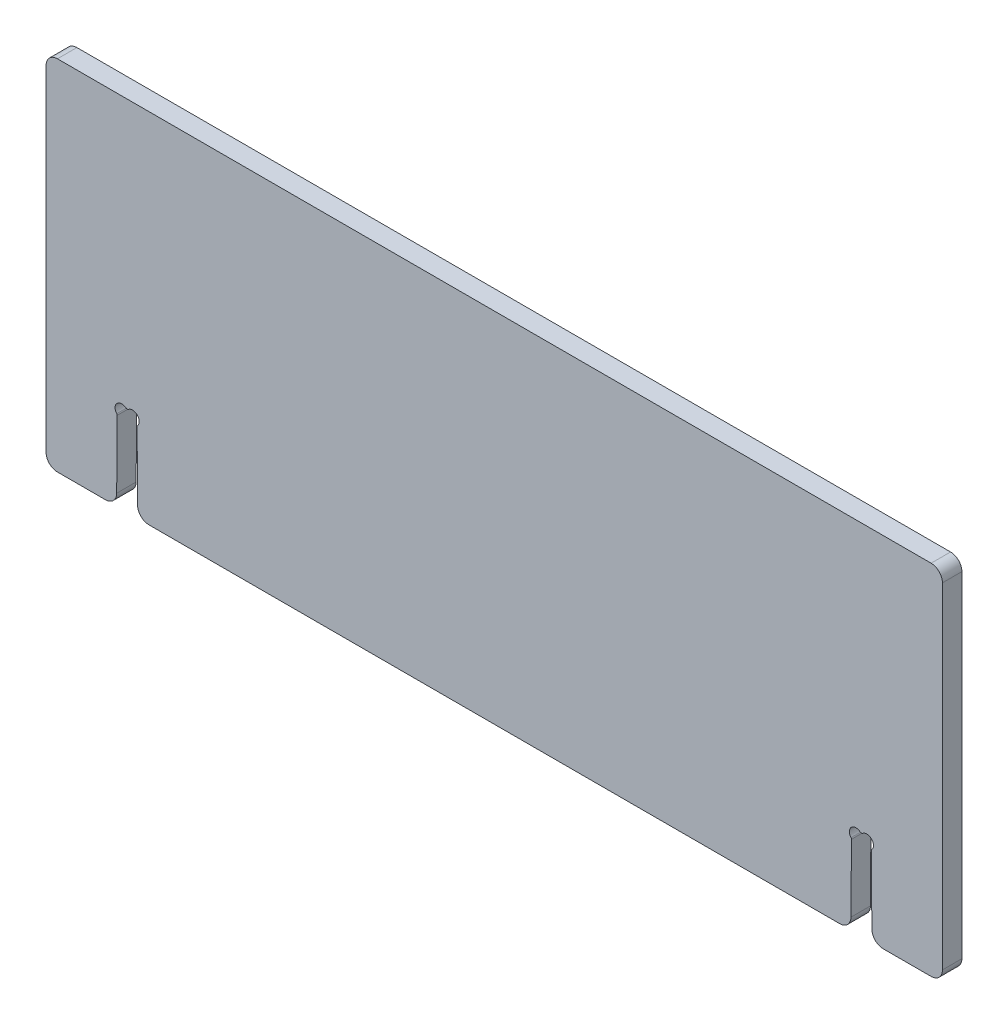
ISO-10303-21;
HEADER;
FILE_DESCRIPTION(('STEP AP214'),'2;1');
FILE_NAME('part.step','',(''),(''),'','','');
FILE_SCHEMA(('AUTOMOTIVE_DESIGN { 1 0 10303 214 1 1 1 1 }'));
ENDSEC;
DATA;
#1=APPLICATION_CONTEXT('core data for automotive mechanical design processes');
#2=APPLICATION_PROTOCOL_DEFINITION('international standard','automotive_design',2000,#1);
#3=PRODUCT_CONTEXT('',#1,'mechanical');
#4=PRODUCT('Part','Part','',(#3));
#5=PRODUCT_RELATED_PRODUCT_CATEGORY('part','',(#4));
#6=PRODUCT_DEFINITION_FORMATION('','',#4);
#7=PRODUCT_DEFINITION_CONTEXT('part definition',#1,'design');
#8=PRODUCT_DEFINITION('design','',#6,#7);
#9=PRODUCT_DEFINITION_SHAPE('','',#8);
#10=(LENGTH_UNIT() NAMED_UNIT(*) SI_UNIT(.MILLI.,.METRE.));
#11=(NAMED_UNIT(*) PLANE_ANGLE_UNIT() SI_UNIT($,.RADIAN.));
#12=(NAMED_UNIT(*) SI_UNIT($,.STERADIAN.) SOLID_ANGLE_UNIT());
#13=UNCERTAINTY_MEASURE_WITH_UNIT(LENGTH_MEASURE(1.E-05),#10,'distance_accuracy_value','');
#14=(GEOMETRIC_REPRESENTATION_CONTEXT(3) GLOBAL_UNCERTAINTY_ASSIGNED_CONTEXT((#13)) GLOBAL_UNIT_ASSIGNED_CONTEXT((#10,
#11,#12)) REPRESENTATION_CONTEXT('',''));
#15=CARTESIAN_POINT('',(0.,0.,0.));
#16=DIRECTION('',(0.,0.,1.));
#17=DIRECTION('',(1.,0.,0.));
#18=AXIS2_PLACEMENT_3D('',#15,#16,#17);
#19=CARTESIAN_POINT('',(0.,0.,12.));
#20=DIRECTION('',(0.,1.,0.));
#21=DIRECTION('',(0.,0.,1.));
#22=AXIS2_PLACEMENT_3D('',#19,#20,#21);
#23=PLANE('',#22);
#24=DIRECTION('',(1.,0.,0.));
#25=VECTOR('',#24,1.);
#26=CARTESIAN_POINT('',(0.,0.,0.));
#27=LINE('',#26,#25);
#28=CARTESIAN_POINT('',(7.,0.,0.));
#29=VERTEX_POINT('',#28);
#30=CARTESIAN_POINT('',(36.5505408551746,0.,0.));
#31=VERTEX_POINT('',#30);
#32=EDGE_CURVE('E458',#29,#31,#27,.T.);
#33=ORIENTED_EDGE('',*,*,#32,.T.);
#34=DIRECTION('',(0.,0.,1.));
#35=VECTOR('',#34,1.);
#36=CARTESIAN_POINT('',(36.5505408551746,0.,12.));
#37=LINE('',#36,#35);
#38=CARTESIAN_POINT('',(36.5505408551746,0.,12.));
#39=VERTEX_POINT('',#38);
#40=EDGE_CURVE('E483',#31,#39,#37,.T.);
#41=ORIENTED_EDGE('',*,*,#40,.T.);
#42=DIRECTION('',(1.,0.,0.));
#43=VECTOR('',#42,1.);
#44=CARTESIAN_POINT('',(0.,0.,12.));
#45=LINE('',#44,#43);
#46=CARTESIAN_POINT('',(7.,0.,12.));
#47=VERTEX_POINT('',#46);
#48=EDGE_CURVE('E451',#47,#39,#45,.T.);
#49=ORIENTED_EDGE('',*,*,#48,.F.);
#50=DIRECTION('',(0.,0.,-1.));
#51=VECTOR('',#50,1.);
#52=CARTESIAN_POINT('',(7.,0.,12.));
#53=LINE('',#52,#51);
#54=EDGE_CURVE('E480',#47,#29,#53,.T.);
#55=ORIENTED_EDGE('',*,*,#54,.T.);
#56=EDGE_LOOP('',(#33,#41,#49,#55));
#57=FACE_BOUND('',#56,.T.);
#58=ADVANCED_FACE('F33',(#57),#23,.F.);
#59=CARTESIAN_POINT('',(0.,0.,12.));
#60=DIRECTION('',(1.,0.,0.));
#61=DIRECTION('',(0.,0.,-1.));
#62=AXIS2_PLACEMENT_3D('',#59,#60,#61);
#63=PLANE('',#62);
#64=DIRECTION('',(0.,-1.,0.));
#65=VECTOR('',#64,1.);
#66=CARTESIAN_POINT('',(0.,0.,0.));
#67=LINE('',#66,#65);
#68=CARTESIAN_POINT('',(0.,213.8,0.));
#69=VERTEX_POINT('',#68);
#70=CARTESIAN_POINT('',(0.,7.,0.));
#71=VERTEX_POINT('',#70);
#72=EDGE_CURVE('E430',#69,#71,#67,.T.);
#73=ORIENTED_EDGE('',*,*,#72,.T.);
#74=DIRECTION('',(0.,0.,-1.));
#75=VECTOR('',#74,1.);
#76=CARTESIAN_POINT('',(0.,7.,12.));
#77=LINE('',#76,#75);
#78=CARTESIAN_POINT('',(0.,7.,12.));
#79=VERTEX_POINT('',#78);
#80=EDGE_CURVE('E41',#71,#79,#77,.F.);
#81=ORIENTED_EDGE('',*,*,#80,.T.);
#82=DIRECTION('',(0.,-1.,0.));
#83=VECTOR('',#82,1.);
#84=CARTESIAN_POINT('',(0.,0.,12.));
#85=LINE('',#84,#83);
#86=CARTESIAN_POINT('',(0.,213.8,12.));
#87=VERTEX_POINT('',#86);
#88=EDGE_CURVE('E445',#87,#79,#85,.T.);
#89=ORIENTED_EDGE('',*,*,#88,.F.);
#90=DIRECTION('',(0.,0.,-1.));
#91=VECTOR('',#90,1.);
#92=CARTESIAN_POINT('',(0.,213.8,12.));
#93=LINE('',#92,#91);
#94=EDGE_CURVE('E488',#87,#69,#93,.T.);
#95=ORIENTED_EDGE('',*,*,#94,.T.);
#96=EDGE_LOOP('',(#73,#81,#89,#95));
#97=FACE_BOUND('',#96,.T.);
#98=ADVANCED_FACE('F493',(#97),#63,.F.);
#99=CARTESIAN_POINT('',(63.4494591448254,0.,12.));
#100=VERTEX_POINT('',#99);
#101=CARTESIAN_POINT('',(489.550540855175,0.,12.));
#102=VERTEX_POINT('',#101);
#103=EDGE_CURVE('E448',#100,#102,#45,.T.);
#104=ORIENTED_EDGE('',*,*,#103,.F.);
#105=DIRECTION('',(0.,0.,1.));
#106=VECTOR('',#105,1.);
#107=CARTESIAN_POINT('',(63.4494591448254,0.,12.));
#108=LINE('',#107,#106);
#109=CARTESIAN_POINT('',(63.4494591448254,0.,0.));
#110=VERTEX_POINT('',#109);
#111=EDGE_CURVE('E472',#100,#110,#108,.F.);
#112=ORIENTED_EDGE('',*,*,#111,.T.);
#113=CARTESIAN_POINT('',(489.550540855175,0.,0.));
#114=VERTEX_POINT('',#113);
#115=EDGE_CURVE('E457',#110,#114,#27,.T.);
#116=ORIENTED_EDGE('',*,*,#115,.T.);
#117=DIRECTION('',(0.,0.,1.));
#118=VECTOR('',#117,1.);
#119=CARTESIAN_POINT('',(489.550540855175,0.,12.));
#120=LINE('',#119,#118);
#121=EDGE_CURVE('E345',#102,#114,#120,.F.);
#122=ORIENTED_EDGE('',*,*,#121,.F.);
#123=EDGE_LOOP('',(#104,#112,#116,#122));
#124=FACE_BOUND('',#123,.T.);
#125=ADVANCED_FACE('F554',(#124),#23,.F.);
#126=CARTESIAN_POINT('',(0.,220.8,12.));
#127=DIRECTION('',(0.,-1.,0.));
#128=DIRECTION('',(0.,0.,-1.));
#129=AXIS2_PLACEMENT_3D('',#126,#127,#128);
#130=PLANE('',#129);
#131=DIRECTION('',(-1.,0.,0.));
#132=VECTOR('',#131,1.);
#133=CARTESIAN_POINT('',(0.,220.8,0.));
#134=LINE('',#133,#132);
#135=CARTESIAN_POINT('',(546.,220.8,0.));
#136=VERTEX_POINT('',#135);
#137=CARTESIAN_POINT('',(7.,220.8,0.));
#138=VERTEX_POINT('',#137);
#139=EDGE_CURVE('E449',#136,#138,#134,.T.);
#140=ORIENTED_EDGE('',*,*,#139,.T.);
#141=DIRECTION('',(0.,0.,-1.));
#142=VECTOR('',#141,1.);
#143=CARTESIAN_POINT('',(7.,220.8,12.));
#144=LINE('',#143,#142);
#145=CARTESIAN_POINT('',(7.,220.8,12.));
#146=VERTEX_POINT('',#145);
#147=EDGE_CURVE('E11',#138,#146,#144,.F.);
#148=ORIENTED_EDGE('',*,*,#147,.T.);
#149=DIRECTION('',(-1.,0.,0.));
#150=VECTOR('',#149,1.);
#151=CARTESIAN_POINT('',(0.,220.8,12.));
#152=LINE('',#151,#150);
#153=CARTESIAN_POINT('',(546.,220.8,12.));
#154=VERTEX_POINT('',#153);
#155=EDGE_CURVE('E452',#154,#146,#152,.T.);
#156=ORIENTED_EDGE('',*,*,#155,.F.);
#157=DIRECTION('',(0.,0.,-1.));
#158=VECTOR('',#157,1.);
#159=CARTESIAN_POINT('',(546.,220.8,12.));
#160=LINE('',#159,#158);
#161=EDGE_CURVE('E372',#136,#154,#160,.F.);
#162=ORIENTED_EDGE('',*,*,#161,.F.);
#163=EDGE_LOOP('',(#140,#148,#156,#162));
#164=FACE_BOUND('',#163,.T.);
#165=ADVANCED_FACE('F607',(#164),#130,.F.);
#166=CARTESIAN_POINT('',(0.,0.,12.));
#167=DIRECTION('',(0.,0.,-1.));
#168=DIRECTION('',(-1.,0.,0.));
#169=AXIS2_PLACEMENT_3D('',#166,#167,#168);
#170=PLANE('',#169);
#171=DIRECTION('',(-0.00724618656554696,0.999973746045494,0.));
#172=VECTOR('',#171,1.);
#173=CARTESIAN_POINT('',(56.1470582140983,48.705966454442,12.));
#174=LINE('',#173,#172);
#175=CARTESIAN_POINT('',(56.449642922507,6.94927669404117,12.));
#176=VERTEX_POINT('',#175);
#177=CARTESIAN_POINT('',(56.1470582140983,48.705966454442,12.));
#178=VERTEX_POINT('',#177);
#179=EDGE_CURVE('E375',#176,#178,#174,.T.);
#180=ORIENTED_EDGE('',*,*,#179,.F.);
#181=CARTESIAN_POINT('',(63.4494591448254,7.,12.));
#182=DIRECTION('',(0.,0.,-1.));
#183=DIRECTION('',(-1.,0.,0.));
#184=AXIS2_PLACEMENT_3D('',#181,#182,#183);
#185=CIRCLE('',#184,7.);
#186=EDGE_CURVE('E470',#176,#100,#185,.F.);
#187=ORIENTED_EDGE('',*,*,#186,.T.);
#188=ORIENTED_EDGE('',*,*,#103,.T.);
#189=CARTESIAN_POINT('',(489.550540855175,7.,12.));
#190=DIRECTION('',(0.,0.,1.));
#191=DIRECTION('',(1.,0.,0.));
#192=AXIS2_PLACEMENT_3D('',#189,#190,#191);
#193=CIRCLE('',#192,7.);
#194=CARTESIAN_POINT('',(496.550357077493,6.94927669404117,12.));
#195=VERTEX_POINT('',#194);
#196=EDGE_CURVE('E342',#195,#102,#193,.F.);
#197=ORIENTED_EDGE('',*,*,#196,.F.);
#198=DIRECTION('',(0.00724618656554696,0.999973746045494,0.));
#199=VECTOR('',#198,1.);
#200=CARTESIAN_POINT('',(496.852941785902,48.705966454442,12.));
#201=LINE('',#200,#199);
#202=CARTESIAN_POINT('',(496.852941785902,48.705966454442,12.));
#203=VERTEX_POINT('',#202);
#204=EDGE_CURVE('E285',#195,#203,#201,.T.);
#205=ORIENTED_EDGE('',*,*,#204,.T.);
#206=CARTESIAN_POINT('',(495.652973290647,48.7146618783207,12.));
#207=DIRECTION('',(0.,0.,1.));
#208=DIRECTION('',(-1.,0.,0.));
#209=AXIS2_PLACEMENT_3D('',#206,#207,#208);
#210=CIRCLE('',#209,1.2);
#211=CARTESIAN_POINT('',(496.561922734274,49.4981227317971,12.));
#212=VERTEX_POINT('',#211);
#213=EDGE_CURVE('E288',#203,#212,#210,.T.);
#214=ORIENTED_EDGE('',*,*,#213,.T.);
#215=CARTESIAN_POINT('',(499.6675,52.1749473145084,12.));
#216=DIRECTION('',(0.,0.,-1.));
#217=DIRECTION('',(1.,0.,0.));
#218=AXIS2_PLACEMENT_3D('',#215,#216,#217);
#219=CIRCLE('',#218,4.1);
#220=CARTESIAN_POINT('',(502.142842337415,55.4433842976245,12.));
#221=VERTEX_POINT('',#220);
#222=EDGE_CURVE('E247',#212,#221,#219,.T.);
#223=ORIENTED_EDGE('',*,*,#222,.T.);
#224=CARTESIAN_POINT('',(502.867332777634,56.4,12.));
#225=DIRECTION('',(0.,0.,1.));
#226=DIRECTION('',(1.,0.,0.));
#227=AXIS2_PLACEMENT_3D('',#224,#225,#226);
#228=CIRCLE('',#227,1.2);
#229=CARTESIAN_POINT('',(502.867332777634,55.2,12.));
#230=VERTEX_POINT('',#229);
#231=EDGE_CURVE('E291',#221,#230,#228,.T.);
#232=ORIENTED_EDGE('',*,*,#231,.T.);
#233=DIRECTION('',(1.,0.,0.));
#234=VECTOR('',#233,1.);
#235=CARTESIAN_POINT('',(503.132667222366,55.2,12.));
#236=LINE('',#235,#234);
#237=CARTESIAN_POINT('',(503.132667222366,55.2,12.));
#238=VERTEX_POINT('',#237);
#239=EDGE_CURVE('E294',#230,#238,#236,.T.);
#240=ORIENTED_EDGE('',*,*,#239,.T.);
#241=CARTESIAN_POINT('',(503.132667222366,56.4,12.));
#242=DIRECTION('',(0.,0.,1.));
#243=DIRECTION('',(-1.,0.,0.));
#244=AXIS2_PLACEMENT_3D('',#241,#242,#243);
#245=CIRCLE('',#244,1.2);
#246=CARTESIAN_POINT('',(503.857157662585,55.4433842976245,12.));
#247=VERTEX_POINT('',#246);
#248=EDGE_CURVE('E297',#238,#247,#245,.T.);
#249=ORIENTED_EDGE('',*,*,#248,.T.);
#250=CARTESIAN_POINT('',(506.3325,52.1749473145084,12.));
#251=DIRECTION('',(0.,0.,-1.));
#252=DIRECTION('',(-1.,0.,0.));
#253=AXIS2_PLACEMENT_3D('',#250,#251,#252);
#254=CIRCLE('',#253,4.1);
#255=CARTESIAN_POINT('',(509.438077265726,49.4981227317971,12.));
#256=VERTEX_POINT('',#255);
#257=EDGE_CURVE('E300',#247,#256,#254,.T.);
#258=ORIENTED_EDGE('',*,*,#257,.T.);
#259=CARTESIAN_POINT('',(510.347026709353,48.7146618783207,12.));
#260=DIRECTION('',(0.,0.,1.));
#261=DIRECTION('',(1.,0.,0.));
#262=AXIS2_PLACEMENT_3D('',#259,#260,#261);
#263=CIRCLE('',#262,1.2);
#264=CARTESIAN_POINT('',(509.147058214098,48.705966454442,12.));
#265=VERTEX_POINT('',#264);
#266=EDGE_CURVE('E303',#256,#265,#263,.T.);
#267=ORIENTED_EDGE('',*,*,#266,.T.);
#268=DIRECTION('',(0.00724618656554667,-0.999973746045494,0.));
#269=VECTOR('',#268,1.);
#270=CARTESIAN_POINT('',(509.147058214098,48.705966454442,12.));
#271=LINE('',#270,#269);
#272=CARTESIAN_POINT('',(509.449642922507,6.94927669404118,12.));
#273=VERTEX_POINT('',#272);
#274=EDGE_CURVE('E306',#265,#273,#271,.T.);
#275=ORIENTED_EDGE('',*,*,#274,.T.);
#276=CARTESIAN_POINT('',(516.449459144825,7.,12.));
#277=DIRECTION('',(0.,0.,1.));
#278=DIRECTION('',(1.,0.,0.));
#279=AXIS2_PLACEMENT_3D('',#276,#277,#278);
#280=CIRCLE('',#279,7.);
#281=CARTESIAN_POINT('',(516.449459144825,0.,12.));
#282=VERTEX_POINT('',#281);
#283=EDGE_CURVE('E339',#282,#273,#280,.F.);
#284=ORIENTED_EDGE('',*,*,#283,.F.);
#285=DIRECTION('',(-1.,0.,0.));
#286=VECTOR('',#285,1.);
#287=CARTESIAN_POINT('',(553.,0.,12.));
#288=LINE('',#287,#286);
#289=CARTESIAN_POINT('',(546.,0.,12.));
#290=VERTEX_POINT('',#289);
#291=EDGE_CURVE('E325',#290,#282,#288,.T.);
#292=ORIENTED_EDGE('',*,*,#291,.F.);
#293=CARTESIAN_POINT('',(546.,7.,12.));
#294=DIRECTION('',(0.,0.,1.));
#295=DIRECTION('',(1.,0.,0.));
#296=AXIS2_PLACEMENT_3D('',#293,#294,#295);
#297=CIRCLE('',#296,7.);
#298=CARTESIAN_POINT('',(553.,7.,12.));
#299=VERTEX_POINT('',#298);
#300=EDGE_CURVE('E337',#299,#290,#297,.F.);
#301=ORIENTED_EDGE('',*,*,#300,.F.);
#302=DIRECTION('',(0.,-1.,0.));
#303=VECTOR('',#302,1.);
#304=CARTESIAN_POINT('',(553.,0.,12.));
#305=LINE('',#304,#303);
#306=CARTESIAN_POINT('',(553.,213.8,12.));
#307=VERTEX_POINT('',#306);
#308=EDGE_CURVE('E322',#307,#299,#305,.T.);
#309=ORIENTED_EDGE('',*,*,#308,.F.);
#310=CARTESIAN_POINT('',(546.,213.8,12.));
#311=DIRECTION('',(0.,0.,1.));
#312=DIRECTION('',(1.,0.,0.));
#313=AXIS2_PLACEMENT_3D('',#310,#311,#312);
#314=CIRCLE('',#313,7.);
#315=EDGE_CURVE('E335',#154,#307,#314,.F.);
#316=ORIENTED_EDGE('',*,*,#315,.F.);
#317=ORIENTED_EDGE('',*,*,#155,.T.);
#318=CARTESIAN_POINT('',(7.,213.8,12.));
#319=DIRECTION('',(0.,0.,-1.));
#320=DIRECTION('',(-1.,0.,0.));
#321=AXIS2_PLACEMENT_3D('',#318,#319,#320);
#322=CIRCLE('',#321,7.);
#323=EDGE_CURVE('E464',#146,#87,#322,.F.);
#324=ORIENTED_EDGE('',*,*,#323,.T.);
#325=ORIENTED_EDGE('',*,*,#88,.T.);
#326=CARTESIAN_POINT('',(7.,7.,12.));
#327=DIRECTION('',(0.,0.,-1.));
#328=DIRECTION('',(-1.,0.,0.));
#329=AXIS2_PLACEMENT_3D('',#326,#327,#328);
#330=CIRCLE('',#329,7.);
#331=EDGE_CURVE('E466',#79,#47,#330,.F.);
#332=ORIENTED_EDGE('',*,*,#331,.T.);
#333=ORIENTED_EDGE('',*,*,#48,.T.);
#334=CARTESIAN_POINT('',(36.5505408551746,7.,12.));
#335=DIRECTION('',(0.,0.,-1.));
#336=DIRECTION('',(-1.,0.,0.));
#337=AXIS2_PLACEMENT_3D('',#334,#335,#336);
#338=CIRCLE('',#337,7.);
#339=CARTESIAN_POINT('',(43.5503570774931,6.94927669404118,12.));
#340=VERTEX_POINT('',#339);
#341=EDGE_CURVE('E468',#39,#340,#338,.F.);
#342=ORIENTED_EDGE('',*,*,#341,.T.);
#343=DIRECTION('',(-0.00724618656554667,-0.999973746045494,0.));
#344=VECTOR('',#343,1.);
#345=CARTESIAN_POINT('',(43.8529417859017,48.705966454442,12.));
#346=LINE('',#345,#344);
#347=CARTESIAN_POINT('',(43.8529417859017,48.705966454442,12.));
#348=VERTEX_POINT('',#347);
#349=EDGE_CURVE('E379',#348,#340,#346,.T.);
#350=ORIENTED_EDGE('',*,*,#349,.F.);
#351=CARTESIAN_POINT('',(42.6529732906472,48.7146618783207,12.));
#352=DIRECTION('',(0.,0.,-1.));
#353=DIRECTION('',(-1.,0.,0.));
#354=AXIS2_PLACEMENT_3D('',#351,#352,#353);
#355=CIRCLE('',#354,1.2);
#356=CARTESIAN_POINT('',(43.5619227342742,49.4981227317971,12.));
#357=VERTEX_POINT('',#356);
#358=EDGE_CURVE('E423',#357,#348,#355,.T.);
#359=ORIENTED_EDGE('',*,*,#358,.F.);
#360=CARTESIAN_POINT('',(46.6675,52.1749473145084,12.));
#361=DIRECTION('',(0.,0.,1.));
#362=DIRECTION('',(1.,0.,0.));
#363=AXIS2_PLACEMENT_3D('',#360,#361,#362);
#364=CIRCLE('',#363,4.1);
#365=CARTESIAN_POINT('',(49.1428423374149,55.4433842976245,12.));
#366=VERTEX_POINT('',#365);
#367=EDGE_CURVE('E420',#366,#357,#364,.T.);
#368=ORIENTED_EDGE('',*,*,#367,.F.);
#369=CARTESIAN_POINT('',(49.8673327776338,56.4,12.));
#370=DIRECTION('',(0.,0.,-1.));
#371=DIRECTION('',(1.,0.,0.));
#372=AXIS2_PLACEMENT_3D('',#369,#370,#371);
#373=CIRCLE('',#372,1.2);
#374=CARTESIAN_POINT('',(49.8673327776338,55.2,12.));
#375=VERTEX_POINT('',#374);
#376=EDGE_CURVE('E417',#375,#366,#373,.T.);
#377=ORIENTED_EDGE('',*,*,#376,.F.);
#378=DIRECTION('',(-1.,0.,0.));
#379=VECTOR('',#378,1.);
#380=CARTESIAN_POINT('',(49.8673327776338,55.2,12.));
#381=LINE('',#380,#379);
#382=CARTESIAN_POINT('',(50.1326672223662,55.2,12.));
#383=VERTEX_POINT('',#382);
#384=EDGE_CURVE('E414',#383,#375,#381,.T.);
#385=ORIENTED_EDGE('',*,*,#384,.F.);
#386=CARTESIAN_POINT('',(50.1326672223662,56.4,12.));
#387=DIRECTION('',(0.,0.,-1.));
#388=DIRECTION('',(-1.,0.,0.));
#389=AXIS2_PLACEMENT_3D('',#386,#387,#388);
#390=CIRCLE('',#389,1.2);
#391=CARTESIAN_POINT('',(50.8571576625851,55.4433842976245,12.));
#392=VERTEX_POINT('',#391);
#393=EDGE_CURVE('E411',#392,#383,#390,.T.);
#394=ORIENTED_EDGE('',*,*,#393,.F.);
#395=CARTESIAN_POINT('',(53.3325,52.1749473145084,12.));
#396=DIRECTION('',(0.,0.,1.));
#397=DIRECTION('',(-1.,0.,0.));
#398=AXIS2_PLACEMENT_3D('',#395,#396,#397);
#399=CIRCLE('',#398,4.1);
#400=CARTESIAN_POINT('',(56.4380772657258,49.4981227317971,12.));
#401=VERTEX_POINT('',#400);
#402=EDGE_CURVE('E408',#401,#392,#399,.T.);
#403=ORIENTED_EDGE('',*,*,#402,.F.);
#404=CARTESIAN_POINT('',(57.3470267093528,48.7146618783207,12.));
#405=DIRECTION('',(0.,0.,-1.));
#406=DIRECTION('',(1.,0.,0.));
#407=AXIS2_PLACEMENT_3D('',#404,#405,#406);
#408=CIRCLE('',#407,1.2);
#409=EDGE_CURVE('E405',#178,#401,#408,.T.);
#410=ORIENTED_EDGE('',*,*,#409,.F.);
#411=EDGE_LOOP('',(#180,#187,#188,#197,#205,#214,#223,#232,#240,#249,#258,#267,#275,#284,#292,
#301,#309,#316,#317,#324,#325,#332,#333,#342,#350,#359,#368,#377,#385,#394,#403,#410));
#412=FACE_BOUND('',#411,.T.);
#413=ADVANCED_FACE('F499',(#412),#170,.F.);
#414=CARTESIAN_POINT('',(0.,0.,0.));
#415=DIRECTION('',(0.,0.,-1.));
#416=DIRECTION('',(-1.,0.,0.));
#417=AXIS2_PLACEMENT_3D('',#414,#415,#416);
#418=PLANE('',#417);
#419=ORIENTED_EDGE('',*,*,#115,.F.);
#420=CARTESIAN_POINT('',(63.4494591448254,7.,0.));
#421=DIRECTION('',(0.,0.,-1.));
#422=DIRECTION('',(-1.,0.,0.));
#423=AXIS2_PLACEMENT_3D('',#420,#421,#422);
#424=CIRCLE('',#423,7.);
#425=CARTESIAN_POINT('',(56.449642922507,6.94927669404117,0.));
#426=VERTEX_POINT('',#425);
#427=EDGE_CURVE('E478',#110,#426,#424,.T.);
#428=ORIENTED_EDGE('',*,*,#427,.T.);
#429=DIRECTION('',(-0.00724618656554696,0.999973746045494,0.));
#430=VECTOR('',#429,1.);
#431=CARTESIAN_POINT('',(56.1470582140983,48.705966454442,0.));
#432=LINE('',#431,#430);
#433=CARTESIAN_POINT('',(56.1470582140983,48.705966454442,0.));
#434=VERTEX_POINT('',#433);
#435=EDGE_CURVE('E376',#426,#434,#432,.T.);
#436=ORIENTED_EDGE('',*,*,#435,.T.);
#437=CARTESIAN_POINT('',(57.3470267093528,48.7146618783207,0.));
#438=DIRECTION('',(0.,0.,-1.));
#439=DIRECTION('',(1.,0.,0.));
#440=AXIS2_PLACEMENT_3D('',#437,#438,#439);
#441=CIRCLE('',#440,1.2);
#442=CARTESIAN_POINT('',(56.4380772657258,49.4981227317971,0.));
#443=VERTEX_POINT('',#442);
#444=EDGE_CURVE('E378',#434,#443,#441,.T.);
#445=ORIENTED_EDGE('',*,*,#444,.T.);
#446=CARTESIAN_POINT('',(53.3325,52.1749473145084,0.));
#447=DIRECTION('',(0.,0.,1.));
#448=DIRECTION('',(-1.,0.,0.));
#449=AXIS2_PLACEMENT_3D('',#446,#447,#448);
#450=CIRCLE('',#449,4.1);
#451=CARTESIAN_POINT('',(50.8571576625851,55.4433842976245,0.));
#452=VERTEX_POINT('',#451);
#453=EDGE_CURVE('E382',#443,#452,#450,.T.);
#454=ORIENTED_EDGE('',*,*,#453,.T.);
#455=CARTESIAN_POINT('',(50.1326672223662,56.4,0.));
#456=DIRECTION('',(0.,0.,-1.));
#457=DIRECTION('',(-1.,0.,0.));
#458=AXIS2_PLACEMENT_3D('',#455,#456,#457);
#459=CIRCLE('',#458,1.2);
#460=CARTESIAN_POINT('',(50.1326672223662,55.2,0.));
#461=VERTEX_POINT('',#460);
#462=EDGE_CURVE('E385',#452,#461,#459,.T.);
#463=ORIENTED_EDGE('',*,*,#462,.T.);
#464=DIRECTION('',(-1.,0.,0.));
#465=VECTOR('',#464,1.);
#466=CARTESIAN_POINT('',(49.8673327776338,55.2,0.));
#467=LINE('',#466,#465);
#468=CARTESIAN_POINT('',(49.8673327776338,55.2,0.));
#469=VERTEX_POINT('',#468);
#470=EDGE_CURVE('E388',#461,#469,#467,.T.);
#471=ORIENTED_EDGE('',*,*,#470,.T.);
#472=CARTESIAN_POINT('',(49.8673327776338,56.4,0.));
#473=DIRECTION('',(0.,0.,-1.));
#474=DIRECTION('',(1.,0.,0.));
#475=AXIS2_PLACEMENT_3D('',#472,#473,#474);
#476=CIRCLE('',#475,1.2);
#477=CARTESIAN_POINT('',(49.1428423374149,55.4433842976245,0.));
#478=VERTEX_POINT('',#477);
#479=EDGE_CURVE('E391',#469,#478,#476,.T.);
#480=ORIENTED_EDGE('',*,*,#479,.T.);
#481=CARTESIAN_POINT('',(46.6675,52.1749473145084,0.));
#482=DIRECTION('',(0.,0.,1.));
#483=DIRECTION('',(1.,0.,0.));
#484=AXIS2_PLACEMENT_3D('',#481,#482,#483);
#485=CIRCLE('',#484,4.1);
#486=CARTESIAN_POINT('',(43.5619227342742,49.4981227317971,0.));
#487=VERTEX_POINT('',#486);
#488=EDGE_CURVE('E394',#478,#487,#485,.T.);
#489=ORIENTED_EDGE('',*,*,#488,.T.);
#490=CARTESIAN_POINT('',(42.6529732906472,48.7146618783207,0.));
#491=DIRECTION('',(0.,0.,-1.));
#492=DIRECTION('',(-1.,0.,0.));
#493=AXIS2_PLACEMENT_3D('',#490,#491,#492);
#494=CIRCLE('',#493,1.2);
#495=CARTESIAN_POINT('',(43.8529417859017,48.705966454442,0.));
#496=VERTEX_POINT('',#495);
#497=EDGE_CURVE('E397',#487,#496,#494,.T.);
#498=ORIENTED_EDGE('',*,*,#497,.T.);
#499=DIRECTION('',(-0.00724618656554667,-0.999973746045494,0.));
#500=VECTOR('',#499,1.);
#501=CARTESIAN_POINT('',(43.8529417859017,48.705966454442,0.));
#502=LINE('',#501,#500);
#503=CARTESIAN_POINT('',(43.5503570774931,6.94927669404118,0.));
#504=VERTEX_POINT('',#503);
#505=EDGE_CURVE('E400',#496,#504,#502,.T.);
#506=ORIENTED_EDGE('',*,*,#505,.T.);
#507=CARTESIAN_POINT('',(36.5505408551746,7.,0.));
#508=DIRECTION('',(0.,0.,-1.));
#509=DIRECTION('',(-1.,0.,0.));
#510=AXIS2_PLACEMENT_3D('',#507,#508,#509);
#511=CIRCLE('',#510,7.);
#512=EDGE_CURVE('E476',#504,#31,#511,.T.);
#513=ORIENTED_EDGE('',*,*,#512,.T.);
#514=ORIENTED_EDGE('',*,*,#32,.F.);
#515=CARTESIAN_POINT('',(7.,7.,0.));
#516=DIRECTION('',(0.,0.,-1.));
#517=DIRECTION('',(-1.,0.,0.));
#518=AXIS2_PLACEMENT_3D('',#515,#516,#517);
#519=CIRCLE('',#518,7.);
#520=EDGE_CURVE('E54',#29,#71,#519,.T.);
#521=ORIENTED_EDGE('',*,*,#520,.T.);
#522=ORIENTED_EDGE('',*,*,#72,.F.);
#523=CARTESIAN_POINT('',(7.,213.8,0.));
#524=DIRECTION('',(0.,0.,-1.));
#525=DIRECTION('',(-1.,0.,0.));
#526=AXIS2_PLACEMENT_3D('',#523,#524,#525);
#527=CIRCLE('',#526,7.);
#528=EDGE_CURVE('E48',#69,#138,#527,.T.);
#529=ORIENTED_EDGE('',*,*,#528,.T.);
#530=ORIENTED_EDGE('',*,*,#139,.F.);
#531=CARTESIAN_POINT('',(546.,213.8,0.));
#532=DIRECTION('',(0.,0.,1.));
#533=DIRECTION('',(1.,0.,0.));
#534=AXIS2_PLACEMENT_3D('',#531,#532,#533);
#535=CIRCLE('',#534,7.);
#536=CARTESIAN_POINT('',(553.,213.8,0.));
#537=VERTEX_POINT('',#536);
#538=EDGE_CURVE('E348',#537,#136,#535,.T.);
#539=ORIENTED_EDGE('',*,*,#538,.F.);
#540=DIRECTION('',(0.,-1.,0.));
#541=VECTOR('',#540,1.);
#542=CARTESIAN_POINT('',(553.,0.,0.));
#543=LINE('',#542,#541);
#544=CARTESIAN_POINT('',(553.,7.,0.));
#545=VERTEX_POINT('',#544);
#546=EDGE_CURVE('E311',#537,#545,#543,.T.);
#547=ORIENTED_EDGE('',*,*,#546,.T.);
#548=CARTESIAN_POINT('',(546.,7.,0.));
#549=DIRECTION('',(0.,0.,1.));
#550=DIRECTION('',(1.,0.,0.));
#551=AXIS2_PLACEMENT_3D('',#548,#549,#550);
#552=CIRCLE('',#551,7.);
#553=CARTESIAN_POINT('',(546.,0.,0.));
#554=VERTEX_POINT('',#553);
#555=EDGE_CURVE('E351',#554,#545,#552,.T.);
#556=ORIENTED_EDGE('',*,*,#555,.F.);
#557=DIRECTION('',(-1.,0.,0.));
#558=VECTOR('',#557,1.);
#559=CARTESIAN_POINT('',(553.,0.,0.));
#560=LINE('',#559,#558);
#561=CARTESIAN_POINT('',(516.449459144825,0.,0.));
#562=VERTEX_POINT('',#561);
#563=EDGE_CURVE('E326',#554,#562,#560,.T.);
#564=ORIENTED_EDGE('',*,*,#563,.T.);
#565=CARTESIAN_POINT('',(516.449459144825,7.,0.));
#566=DIRECTION('',(0.,0.,1.));
#567=DIRECTION('',(1.,0.,0.));
#568=AXIS2_PLACEMENT_3D('',#565,#566,#567);
#569=CIRCLE('',#568,7.);
#570=CARTESIAN_POINT('',(509.449642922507,6.94927669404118,0.));
#571=VERTEX_POINT('',#570);
#572=EDGE_CURVE('E353',#571,#562,#569,.T.);
#573=ORIENTED_EDGE('',*,*,#572,.F.);
#574=DIRECTION('',(0.00724618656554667,-0.999973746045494,0.));
#575=VECTOR('',#574,1.);
#576=CARTESIAN_POINT('',(509.147058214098,48.705966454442,0.));
#577=LINE('',#576,#575);
#578=CARTESIAN_POINT('',(509.147058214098,48.705966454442,0.));
#579=VERTEX_POINT('',#578);
#580=EDGE_CURVE('E282',#579,#571,#577,.T.);
#581=ORIENTED_EDGE('',*,*,#580,.F.);
#582=CARTESIAN_POINT('',(510.347026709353,48.7146618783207,0.));
#583=DIRECTION('',(0.,0.,1.));
#584=DIRECTION('',(1.,0.,0.));
#585=AXIS2_PLACEMENT_3D('',#582,#583,#584);
#586=CIRCLE('',#585,1.2);
#587=CARTESIAN_POINT('',(509.438077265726,49.4981227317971,0.));
#588=VERTEX_POINT('',#587);
#589=EDGE_CURVE('E279',#588,#579,#586,.T.);
#590=ORIENTED_EDGE('',*,*,#589,.F.);
#591=CARTESIAN_POINT('',(506.3325,52.1749473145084,0.));
#592=DIRECTION('',(0.,0.,-1.));
#593=DIRECTION('',(-1.,0.,0.));
#594=AXIS2_PLACEMENT_3D('',#591,#592,#593);
#595=CIRCLE('',#594,4.1);
#596=CARTESIAN_POINT('',(503.857157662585,55.4433842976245,0.));
#597=VERTEX_POINT('',#596);
#598=EDGE_CURVE('E276',#597,#588,#595,.T.);
#599=ORIENTED_EDGE('',*,*,#598,.F.);
#600=CARTESIAN_POINT('',(503.132667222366,56.4,0.));
#601=DIRECTION('',(0.,0.,1.));
#602=DIRECTION('',(-1.,0.,0.));
#603=AXIS2_PLACEMENT_3D('',#600,#601,#602);
#604=CIRCLE('',#603,1.2);
#605=CARTESIAN_POINT('',(503.132667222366,55.2,0.));
#606=VERTEX_POINT('',#605);
#607=EDGE_CURVE('E273',#606,#597,#604,.T.);
#608=ORIENTED_EDGE('',*,*,#607,.F.);
#609=DIRECTION('',(1.,0.,0.));
#610=VECTOR('',#609,1.);
#611=CARTESIAN_POINT('',(503.132667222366,55.2,0.));
#612=LINE('',#611,#610);
#613=CARTESIAN_POINT('',(502.867332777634,55.2,0.));
#614=VERTEX_POINT('',#613);
#615=EDGE_CURVE('E267',#614,#606,#612,.T.);
#616=ORIENTED_EDGE('',*,*,#615,.F.);
#617=CARTESIAN_POINT('',(502.867332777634,56.4,0.));
#618=DIRECTION('',(0.,0.,1.));
#619=DIRECTION('',(1.,0.,0.));
#620=AXIS2_PLACEMENT_3D('',#617,#618,#619);
#621=CIRCLE('',#620,1.2);
#622=CARTESIAN_POINT('',(502.142842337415,55.4433842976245,0.));
#623=VERTEX_POINT('',#622);
#624=EDGE_CURVE('E265',#623,#614,#621,.T.);
#625=ORIENTED_EDGE('',*,*,#624,.F.);
#626=CARTESIAN_POINT('',(499.6675,52.1749473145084,0.));
#627=DIRECTION('',(0.,0.,-1.));
#628=DIRECTION('',(1.,0.,0.));
#629=AXIS2_PLACEMENT_3D('',#626,#627,#628);
#630=CIRCLE('',#629,4.1);
#631=CARTESIAN_POINT('',(496.561922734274,49.4981227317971,0.));
#632=VERTEX_POINT('',#631);
#633=EDGE_CURVE('E244',#632,#623,#630,.T.);
#634=ORIENTED_EDGE('',*,*,#633,.F.);
#635=CARTESIAN_POINT('',(495.652973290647,48.7146618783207,0.));
#636=DIRECTION('',(0.,0.,1.));
#637=DIRECTION('',(-1.,0.,0.));
#638=AXIS2_PLACEMENT_3D('',#635,#636,#637);
#639=CIRCLE('',#638,1.2);
#640=CARTESIAN_POINT('',(496.852941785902,48.705966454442,0.));
#641=VERTEX_POINT('',#640);
#642=EDGE_CURVE('E255',#641,#632,#639,.T.);
#643=ORIENTED_EDGE('',*,*,#642,.F.);
#644=DIRECTION('',(0.00724618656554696,0.999973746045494,0.));
#645=VECTOR('',#644,1.);
#646=CARTESIAN_POINT('',(496.852941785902,48.705966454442,0.));
#647=LINE('',#646,#645);
#648=CARTESIAN_POINT('',(496.550357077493,6.94927669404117,0.));
#649=VERTEX_POINT('',#648);
#650=EDGE_CURVE('E259',#649,#641,#647,.T.);
#651=ORIENTED_EDGE('',*,*,#650,.F.);
#652=CARTESIAN_POINT('',(489.550540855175,7.,0.));
#653=DIRECTION('',(0.,0.,1.));
#654=DIRECTION('',(1.,0.,0.));
#655=AXIS2_PLACEMENT_3D('',#652,#653,#654);
#656=CIRCLE('',#655,7.);
#657=EDGE_CURVE('E355',#114,#649,#656,.T.);
#658=ORIENTED_EDGE('',*,*,#657,.F.);
#659=EDGE_LOOP('',(#419,#428,#436,#445,#454,#463,#471,#480,#489,#498,#506,#513,#514,#521,#522,
#529,#530,#539,#547,#556,#564,#573,#581,#590,#599,#608,#616,#625,#634,#643,#651,#658));
#660=FACE_BOUND('',#659,.T.);
#661=ADVANCED_FACE('F262',(#660),#418,.T.);
#662=CARTESIAN_POINT('',(43.8529417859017,48.705966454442,0.));
#663=DIRECTION('',(-0.999973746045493,0.00724618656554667,0.));
#664=DIRECTION('',(-0.00724618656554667,-0.999973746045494,0.));
#665=AXIS2_PLACEMENT_3D('',#662,#663,#664);
#666=PLANE('',#665);
#667=ORIENTED_EDGE('',*,*,#349,.T.);
#668=DIRECTION('',(0.,0.,1.));
#669=VECTOR('',#668,1.);
#670=CARTESIAN_POINT('',(43.5503570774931,6.94927669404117,0.));
#671=LINE('',#670,#669);
#672=EDGE_CURVE('E486',#340,#504,#671,.F.);
#673=ORIENTED_EDGE('',*,*,#672,.T.);
#674=ORIENTED_EDGE('',*,*,#505,.F.);
#675=DIRECTION('',(0.,0.,1.));
#676=VECTOR('',#675,1.);
#677=CARTESIAN_POINT('',(43.8529417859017,48.705966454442,0.));
#678=LINE('',#677,#676);
#679=EDGE_CURVE('E428',#496,#348,#678,.T.);
#680=ORIENTED_EDGE('',*,*,#679,.T.);
#681=EDGE_LOOP('',(#667,#673,#674,#680));
#682=FACE_BOUND('',#681,.T.);
#683=ADVANCED_FACE('F515',(#682),#666,.F.);
#684=CARTESIAN_POINT('',(42.6529732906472,48.7146618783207,0.));
#685=DIRECTION('',(0.,0.,1.));
#686=DIRECTION('',(1.,0.,0.));
#687=AXIS2_PLACEMENT_3D('',#684,#685,#686);
#688=CYLINDRICAL_SURFACE('',#687,1.2);
#689=ORIENTED_EDGE('',*,*,#358,.T.);
#690=ORIENTED_EDGE('',*,*,#679,.F.);
#691=ORIENTED_EDGE('',*,*,#497,.F.);
#692=DIRECTION('',(0.,0.,1.));
#693=VECTOR('',#692,1.);
#694=CARTESIAN_POINT('',(43.5619227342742,49.4981227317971,0.));
#695=LINE('',#694,#693);
#696=EDGE_CURVE('E431',#487,#357,#695,.T.);
#697=ORIENTED_EDGE('',*,*,#696,.T.);
#698=EDGE_LOOP('',(#689,#690,#691,#697));
#699=FACE_BOUND('',#698,.T.);
#700=ADVANCED_FACE('F518',(#699),#688,.T.);
#701=CARTESIAN_POINT('',(46.6675,52.1749473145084,0.));
#702=DIRECTION('',(0.,0.,1.));
#703=DIRECTION('',(1.,0.,0.));
#704=AXIS2_PLACEMENT_3D('',#701,#702,#703);
#705=CYLINDRICAL_SURFACE('',#704,4.1);
#706=ORIENTED_EDGE('',*,*,#367,.T.);
#707=ORIENTED_EDGE('',*,*,#696,.F.);
#708=ORIENTED_EDGE('',*,*,#488,.F.);
#709=DIRECTION('',(0.,0.,1.));
#710=VECTOR('',#709,1.);
#711=CARTESIAN_POINT('',(49.1428423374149,55.4433842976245,0.));
#712=LINE('',#711,#710);
#713=EDGE_CURVE('E433',#478,#366,#712,.T.);
#714=ORIENTED_EDGE('',*,*,#713,.T.);
#715=EDGE_LOOP('',(#706,#707,#708,#714));
#716=FACE_BOUND('',#715,.T.);
#717=ADVANCED_FACE('F523',(#716),#705,.F.);
#718=CARTESIAN_POINT('',(49.8673327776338,56.4,0.));
#719=DIRECTION('',(0.,0.,1.));
#720=DIRECTION('',(1.,0.,0.));
#721=AXIS2_PLACEMENT_3D('',#718,#719,#720);
#722=CYLINDRICAL_SURFACE('',#721,1.2);
#723=ORIENTED_EDGE('',*,*,#376,.T.);
#724=ORIENTED_EDGE('',*,*,#713,.F.);
#725=ORIENTED_EDGE('',*,*,#479,.F.);
#726=DIRECTION('',(0.,0.,1.));
#727=VECTOR('',#726,1.);
#728=CARTESIAN_POINT('',(49.8673327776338,55.2,0.));
#729=LINE('',#728,#727);
#730=EDGE_CURVE('E435',#469,#375,#729,.T.);
#731=ORIENTED_EDGE('',*,*,#730,.T.);
#732=EDGE_LOOP('',(#723,#724,#725,#731));
#733=FACE_BOUND('',#732,.T.);
#734=ADVANCED_FACE('F527',(#733),#722,.T.);
#735=CARTESIAN_POINT('',(49.8673327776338,55.2,0.));
#736=DIRECTION('',(0.,1.,0.));
#737=DIRECTION('',(0.,0.,1.));
#738=AXIS2_PLACEMENT_3D('',#735,#736,#737);
#739=PLANE('',#738);
#740=ORIENTED_EDGE('',*,*,#384,.T.);
#741=ORIENTED_EDGE('',*,*,#730,.F.);
#742=ORIENTED_EDGE('',*,*,#470,.F.);
#743=DIRECTION('',(0.,0.,1.));
#744=VECTOR('',#743,1.);
#745=CARTESIAN_POINT('',(50.1326672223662,55.2,0.));
#746=LINE('',#745,#744);
#747=EDGE_CURVE('E437',#461,#383,#746,.T.);
#748=ORIENTED_EDGE('',*,*,#747,.T.);
#749=EDGE_LOOP('',(#740,#741,#742,#748));
#750=FACE_BOUND('',#749,.T.);
#751=ADVANCED_FACE('F530',(#750),#739,.F.);
#752=CARTESIAN_POINT('',(50.1326672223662,56.4,0.));
#753=DIRECTION('',(0.,0.,1.));
#754=DIRECTION('',(1.,0.,0.));
#755=AXIS2_PLACEMENT_3D('',#752,#753,#754);
#756=CYLINDRICAL_SURFACE('',#755,1.2);
#757=ORIENTED_EDGE('',*,*,#393,.T.);
#758=ORIENTED_EDGE('',*,*,#747,.F.);
#759=ORIENTED_EDGE('',*,*,#462,.F.);
#760=DIRECTION('',(0.,0.,1.));
#761=VECTOR('',#760,1.);
#762=CARTESIAN_POINT('',(50.8571576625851,55.4433842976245,0.));
#763=LINE('',#762,#761);
#764=EDGE_CURVE('E439',#452,#392,#763,.T.);
#765=ORIENTED_EDGE('',*,*,#764,.T.);
#766=EDGE_LOOP('',(#757,#758,#759,#765));
#767=FACE_BOUND('',#766,.T.);
#768=ADVANCED_FACE('F535',(#767),#756,.T.);
#769=CARTESIAN_POINT('',(53.3325,52.1749473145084,0.));
#770=DIRECTION('',(0.,0.,1.));
#771=DIRECTION('',(1.,0.,0.));
#772=AXIS2_PLACEMENT_3D('',#769,#770,#771);
#773=CYLINDRICAL_SURFACE('',#772,4.1);
#774=ORIENTED_EDGE('',*,*,#402,.T.);
#775=ORIENTED_EDGE('',*,*,#764,.F.);
#776=ORIENTED_EDGE('',*,*,#453,.F.);
#777=DIRECTION('',(0.,0.,1.));
#778=VECTOR('',#777,1.);
#779=CARTESIAN_POINT('',(56.4380772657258,49.4981227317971,0.));
#780=LINE('',#779,#778);
#781=EDGE_CURVE('E441',#443,#401,#780,.T.);
#782=ORIENTED_EDGE('',*,*,#781,.T.);
#783=EDGE_LOOP('',(#774,#775,#776,#782));
#784=FACE_BOUND('',#783,.T.);
#785=ADVANCED_FACE('F539',(#784),#773,.F.);
#786=CARTESIAN_POINT('',(57.3470267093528,48.7146618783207,0.));
#787=DIRECTION('',(0.,0.,1.));
#788=DIRECTION('',(1.,0.,0.));
#789=AXIS2_PLACEMENT_3D('',#786,#787,#788);
#790=CYLINDRICAL_SURFACE('',#789,1.2);
#791=ORIENTED_EDGE('',*,*,#409,.T.);
#792=ORIENTED_EDGE('',*,*,#781,.F.);
#793=ORIENTED_EDGE('',*,*,#444,.F.);
#794=DIRECTION('',(0.,0.,1.));
#795=VECTOR('',#794,1.);
#796=CARTESIAN_POINT('',(56.1470582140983,48.705966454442,0.));
#797=LINE('',#796,#795);
#798=EDGE_CURVE('E403',#434,#178,#797,.T.);
#799=ORIENTED_EDGE('',*,*,#798,.T.);
#800=EDGE_LOOP('',(#791,#792,#793,#799));
#801=FACE_BOUND('',#800,.T.);
#802=ADVANCED_FACE('F542',(#801),#790,.T.);
#803=CARTESIAN_POINT('',(56.1470582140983,48.705966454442,0.));
#804=DIRECTION('',(0.999973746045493,0.00724618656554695,0.));
#805=DIRECTION('',(-0.00724618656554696,0.999973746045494,0.));
#806=AXIS2_PLACEMENT_3D('',#803,#804,#805);
#807=PLANE('',#806);
#808=ORIENTED_EDGE('',*,*,#435,.F.);
#809=DIRECTION('',(0.,0.,1.));
#810=VECTOR('',#809,1.);
#811=CARTESIAN_POINT('',(56.449642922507,6.94927669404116,0.));
#812=LINE('',#811,#810);
#813=EDGE_CURVE('E455',#426,#176,#812,.T.);
#814=ORIENTED_EDGE('',*,*,#813,.T.);
#815=ORIENTED_EDGE('',*,*,#179,.T.);
#816=ORIENTED_EDGE('',*,*,#798,.F.);
#817=EDGE_LOOP('',(#808,#814,#815,#816));
#818=FACE_BOUND('',#817,.T.);
#819=ADVANCED_FACE('F547',(#818),#807,.F.);
#820=CARTESIAN_POINT('',(63.4494591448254,7.,0.));
#821=DIRECTION('',(0.,0.,1.));
#822=DIRECTION('',(1.,0.,0.));
#823=AXIS2_PLACEMENT_3D('',#820,#821,#822);
#824=CYLINDRICAL_SURFACE('',#823,7.);
#825=ORIENTED_EDGE('',*,*,#427,.F.);
#826=ORIENTED_EDGE('',*,*,#111,.F.);
#827=ORIENTED_EDGE('',*,*,#186,.F.);
#828=ORIENTED_EDGE('',*,*,#813,.F.);
#829=EDGE_LOOP('',(#825,#826,#827,#828));
#830=FACE_BOUND('',#829,.T.);
#831=ADVANCED_FACE('F551',(#830),#824,.T.);
#832=CARTESIAN_POINT('',(36.5505408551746,7.,12.));
#833=DIRECTION('',(0.,0.,1.));
#834=DIRECTION('',(1.,0.,0.));
#835=AXIS2_PLACEMENT_3D('',#832,#833,#834);
#836=CYLINDRICAL_SURFACE('',#835,7.);
#837=ORIENTED_EDGE('',*,*,#512,.F.);
#838=ORIENTED_EDGE('',*,*,#672,.F.);
#839=ORIENTED_EDGE('',*,*,#341,.F.);
#840=ORIENTED_EDGE('',*,*,#40,.F.);
#841=EDGE_LOOP('',(#837,#838,#839,#840));
#842=FACE_BOUND('',#841,.T.);
#843=ADVANCED_FACE('F511',(#842),#836,.T.);
#844=CARTESIAN_POINT('',(7.,7.,12.));
#845=DIRECTION('',(0.,0.,-1.));
#846=DIRECTION('',(-1.,0.,0.));
#847=AXIS2_PLACEMENT_3D('',#844,#845,#846);
#848=CYLINDRICAL_SURFACE('',#847,7.);
#849=ORIENTED_EDGE('',*,*,#331,.F.);
#850=ORIENTED_EDGE('',*,*,#80,.F.);
#851=ORIENTED_EDGE('',*,*,#520,.F.);
#852=ORIENTED_EDGE('',*,*,#54,.F.);
#853=EDGE_LOOP('',(#849,#850,#851,#852));
#854=FACE_BOUND('',#853,.T.);
#855=ADVANCED_FACE('F504',(#854),#848,.T.);
#856=CARTESIAN_POINT('',(7.,213.8,12.));
#857=DIRECTION('',(0.,0.,-1.));
#858=DIRECTION('',(-1.,0.,0.));
#859=AXIS2_PLACEMENT_3D('',#856,#857,#858);
#860=CYLINDRICAL_SURFACE('',#859,7.);
#861=ORIENTED_EDGE('',*,*,#323,.F.);
#862=ORIENTED_EDGE('',*,*,#147,.F.);
#863=ORIENTED_EDGE('',*,*,#528,.F.);
#864=ORIENTED_EDGE('',*,*,#94,.F.);
#865=EDGE_LOOP('',(#861,#862,#863,#864));
#866=FACE_BOUND('',#865,.T.);
#867=ADVANCED_FACE('F35',(#866),#860,.T.);
#868=CARTESIAN_POINT('',(553.,0.,12.));
#869=DIRECTION('',(0.,1.,0.));
#870=DIRECTION('',(0.,0.,1.));
#871=AXIS2_PLACEMENT_3D('',#868,#869,#870);
#872=PLANE('',#871);
#873=ORIENTED_EDGE('',*,*,#563,.F.);
#874=DIRECTION('',(0.,0.,-1.));
#875=VECTOR('',#874,1.);
#876=CARTESIAN_POINT('',(546.,0.,12.));
#877=LINE('',#876,#875);
#878=EDGE_CURVE('E358',#290,#554,#877,.T.);
#879=ORIENTED_EDGE('',*,*,#878,.F.);
#880=ORIENTED_EDGE('',*,*,#291,.T.);
#881=DIRECTION('',(0.,0.,1.));
#882=VECTOR('',#881,1.);
#883=CARTESIAN_POINT('',(516.449459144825,0.,12.));
#884=LINE('',#883,#882);
#885=EDGE_CURVE('E361',#562,#282,#884,.T.);
#886=ORIENTED_EDGE('',*,*,#885,.F.);
#887=EDGE_LOOP('',(#873,#879,#880,#886));
#888=FACE_BOUND('',#887,.T.);
#889=ADVANCED_FACE('F593',(#888),#872,.F.);
#890=CARTESIAN_POINT('',(553.,0.,12.));
#891=DIRECTION('',(-1.,0.,0.));
#892=DIRECTION('',(0.,0.,-1.));
#893=AXIS2_PLACEMENT_3D('',#890,#891,#892);
#894=PLANE('',#893);
#895=ORIENTED_EDGE('',*,*,#546,.F.);
#896=DIRECTION('',(0.,0.,-1.));
#897=VECTOR('',#896,1.);
#898=CARTESIAN_POINT('',(553.,213.8,12.));
#899=LINE('',#898,#897);
#900=EDGE_CURVE('E366',#307,#537,#899,.T.);
#901=ORIENTED_EDGE('',*,*,#900,.F.);
#902=ORIENTED_EDGE('',*,*,#308,.T.);
#903=DIRECTION('',(0.,0.,-1.));
#904=VECTOR('',#903,1.);
#905=CARTESIAN_POINT('',(553.,7.,12.));
#906=LINE('',#905,#904);
#907=EDGE_CURVE('E369',#545,#299,#906,.F.);
#908=ORIENTED_EDGE('',*,*,#907,.F.);
#909=EDGE_LOOP('',(#895,#901,#902,#908));
#910=FACE_BOUND('',#909,.T.);
#911=ADVANCED_FACE('F602',(#910),#894,.F.);
#912=CARTESIAN_POINT('',(509.147058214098,48.705966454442,0.));
#913=DIRECTION('',(0.999973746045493,0.00724618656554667,0.));
#914=DIRECTION('',(0.00724618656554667,-0.999973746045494,0.));
#915=AXIS2_PLACEMENT_3D('',#912,#913,#914);
#916=PLANE('',#915);
#917=ORIENTED_EDGE('',*,*,#274,.F.);
#918=DIRECTION('',(0.,0.,1.));
#919=VECTOR('',#918,1.);
#920=CARTESIAN_POINT('',(509.147058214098,48.705966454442,0.));
#921=LINE('',#920,#919);
#922=EDGE_CURVE('E309',#579,#265,#921,.T.);
#923=ORIENTED_EDGE('',*,*,#922,.F.);
#924=ORIENTED_EDGE('',*,*,#580,.T.);
#925=DIRECTION('',(0.,0.,1.));
#926=VECTOR('',#925,1.);
#927=CARTESIAN_POINT('',(509.449642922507,6.94927669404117,0.));
#928=LINE('',#927,#926);
#929=EDGE_CURVE('E364',#273,#571,#928,.F.);
#930=ORIENTED_EDGE('',*,*,#929,.F.);
#931=EDGE_LOOP('',(#917,#923,#924,#930));
#932=FACE_BOUND('',#931,.T.);
#933=ADVANCED_FACE('F584',(#932),#916,.F.);
#934=CARTESIAN_POINT('',(510.347026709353,48.7146618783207,0.));
#935=DIRECTION('',(0.,0.,1.));
#936=DIRECTION('',(-1.,0.,0.));
#937=AXIS2_PLACEMENT_3D('',#934,#935,#936);
#938=CYLINDRICAL_SURFACE('',#937,1.2);
#939=ORIENTED_EDGE('',*,*,#266,.F.);
#940=DIRECTION('',(0.,0.,1.));
#941=VECTOR('',#940,1.);
#942=CARTESIAN_POINT('',(509.438077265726,49.4981227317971,0.));
#943=LINE('',#942,#941);
#944=EDGE_CURVE('E312',#588,#256,#943,.T.);
#945=ORIENTED_EDGE('',*,*,#944,.F.);
#946=ORIENTED_EDGE('',*,*,#589,.T.);
#947=ORIENTED_EDGE('',*,*,#922,.T.);
#948=EDGE_LOOP('',(#939,#945,#946,#947));
#949=FACE_BOUND('',#948,.T.);
#950=ADVANCED_FACE('F580',(#949),#938,.T.);
#951=CARTESIAN_POINT('',(506.3325,52.1749473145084,0.));
#952=DIRECTION('',(0.,0.,1.));
#953=DIRECTION('',(-1.,0.,0.));
#954=AXIS2_PLACEMENT_3D('',#951,#952,#953);
#955=CYLINDRICAL_SURFACE('',#954,4.1);
#956=ORIENTED_EDGE('',*,*,#257,.F.);
#957=DIRECTION('',(0.,0.,1.));
#958=VECTOR('',#957,1.);
#959=CARTESIAN_POINT('',(503.857157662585,55.4433842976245,0.));
#960=LINE('',#959,#958);
#961=EDGE_CURVE('E314',#597,#247,#960,.T.);
#962=ORIENTED_EDGE('',*,*,#961,.F.);
#963=ORIENTED_EDGE('',*,*,#598,.T.);
#964=ORIENTED_EDGE('',*,*,#944,.T.);
#965=EDGE_LOOP('',(#956,#962,#963,#964));
#966=FACE_BOUND('',#965,.T.);
#967=ADVANCED_FACE('F576',(#966),#955,.F.);
#968=CARTESIAN_POINT('',(503.132667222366,56.4,0.));
#969=DIRECTION('',(0.,0.,1.));
#970=DIRECTION('',(-1.,0.,0.));
#971=AXIS2_PLACEMENT_3D('',#968,#969,#970);
#972=CYLINDRICAL_SURFACE('',#971,1.2);
#973=ORIENTED_EDGE('',*,*,#248,.F.);
#974=DIRECTION('',(0.,0.,1.));
#975=VECTOR('',#974,1.);
#976=CARTESIAN_POINT('',(503.132667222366,55.2,0.));
#977=LINE('',#976,#975);
#978=EDGE_CURVE('E316',#606,#238,#977,.T.);
#979=ORIENTED_EDGE('',*,*,#978,.F.);
#980=ORIENTED_EDGE('',*,*,#607,.T.);
#981=ORIENTED_EDGE('',*,*,#961,.T.);
#982=EDGE_LOOP('',(#973,#979,#980,#981));
#983=FACE_BOUND('',#982,.T.);
#984=ADVANCED_FACE('F572',(#983),#972,.T.);
#985=CARTESIAN_POINT('',(503.132667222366,55.2,0.));
#986=DIRECTION('',(0.,1.,0.));
#987=DIRECTION('',(0.,0.,1.));
#988=AXIS2_PLACEMENT_3D('',#985,#986,#987);
#989=PLANE('',#988);
#990=ORIENTED_EDGE('',*,*,#239,.F.);
#991=DIRECTION('',(0.,0.,1.));
#992=VECTOR('',#991,1.);
#993=CARTESIAN_POINT('',(502.867332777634,55.2,0.));
#994=LINE('',#993,#992);
#995=EDGE_CURVE('E318',#614,#230,#994,.T.);
#996=ORIENTED_EDGE('',*,*,#995,.F.);
#997=ORIENTED_EDGE('',*,*,#615,.T.);
#998=ORIENTED_EDGE('',*,*,#978,.T.);
#999=EDGE_LOOP('',(#990,#996,#997,#998));
#1000=FACE_BOUND('',#999,.T.);
#1001=ADVANCED_FACE('F568',(#1000),#989,.F.);
#1002=CARTESIAN_POINT('',(502.867332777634,56.4,0.));
#1003=DIRECTION('',(0.,0.,1.));
#1004=DIRECTION('',(-1.,0.,0.));
#1005=AXIS2_PLACEMENT_3D('',#1002,#1003,#1004);
#1006=CYLINDRICAL_SURFACE('',#1005,1.2);
#1007=ORIENTED_EDGE('',*,*,#231,.F.);
#1008=DIRECTION('',(0.,0.,1.));
#1009=VECTOR('',#1008,1.);
#1010=CARTESIAN_POINT('',(502.142842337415,55.4433842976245,0.));
#1011=LINE('',#1010,#1009);
#1012=EDGE_CURVE('E251',#623,#221,#1011,.T.);
#1013=ORIENTED_EDGE('',*,*,#1012,.F.);
#1014=ORIENTED_EDGE('',*,*,#624,.T.);
#1015=ORIENTED_EDGE('',*,*,#995,.T.);
#1016=EDGE_LOOP('',(#1007,#1013,#1014,#1015));
#1017=FACE_BOUND('',#1016,.T.);
#1018=ADVANCED_FACE('F566',(#1017),#1006,.T.);
#1019=CARTESIAN_POINT('',(499.6675,52.1749473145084,0.));
#1020=DIRECTION('',(0.,0.,1.));
#1021=DIRECTION('',(-1.,0.,0.));
#1022=AXIS2_PLACEMENT_3D('',#1019,#1020,#1021);
#1023=CYLINDRICAL_SURFACE('',#1022,4.1);
#1024=ORIENTED_EDGE('',*,*,#222,.F.);
#1025=DIRECTION('',(0.,0.,1.));
#1026=VECTOR('',#1025,1.);
#1027=CARTESIAN_POINT('',(496.561922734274,49.4981227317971,0.));
#1028=LINE('',#1027,#1026);
#1029=EDGE_CURVE('E240',#632,#212,#1028,.T.);
#1030=ORIENTED_EDGE('',*,*,#1029,.F.);
#1031=ORIENTED_EDGE('',*,*,#633,.T.);
#1032=ORIENTED_EDGE('',*,*,#1012,.T.);
#1033=EDGE_LOOP('',(#1024,#1030,#1031,#1032));
#1034=FACE_BOUND('',#1033,.T.);
#1035=ADVANCED_FACE('F242',(#1034),#1023,.F.);
#1036=CARTESIAN_POINT('',(495.652973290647,48.7146618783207,0.));
#1037=DIRECTION('',(0.,0.,1.));
#1038=DIRECTION('',(-1.,0.,0.));
#1039=AXIS2_PLACEMENT_3D('',#1036,#1037,#1038);
#1040=CYLINDRICAL_SURFACE('',#1039,1.2);
#1041=ORIENTED_EDGE('',*,*,#213,.F.);
#1042=DIRECTION('',(0.,0.,1.));
#1043=VECTOR('',#1042,1.);
#1044=CARTESIAN_POINT('',(496.852941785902,48.705966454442,0.));
#1045=LINE('',#1044,#1043);
#1046=EDGE_CURVE('E252',#641,#203,#1045,.T.);
#1047=ORIENTED_EDGE('',*,*,#1046,.F.);
#1048=ORIENTED_EDGE('',*,*,#642,.T.);
#1049=ORIENTED_EDGE('',*,*,#1029,.T.);
#1050=EDGE_LOOP('',(#1041,#1047,#1048,#1049));
#1051=FACE_BOUND('',#1050,.T.);
#1052=ADVANCED_FACE('F256',(#1051),#1040,.T.);
#1053=CARTESIAN_POINT('',(496.852941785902,48.705966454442,0.));
#1054=DIRECTION('',(-0.999973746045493,0.00724618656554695,0.));
#1055=DIRECTION('',(0.00724618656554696,0.999973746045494,0.));
#1056=AXIS2_PLACEMENT_3D('',#1053,#1054,#1055);
#1057=PLANE('',#1056);
#1058=ORIENTED_EDGE('',*,*,#650,.T.);
#1059=ORIENTED_EDGE('',*,*,#1046,.T.);
#1060=ORIENTED_EDGE('',*,*,#204,.F.);
#1061=DIRECTION('',(0.,0.,1.));
#1062=VECTOR('',#1061,1.);
#1063=CARTESIAN_POINT('',(496.550357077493,6.94927669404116,0.));
#1064=LINE('',#1063,#1062);
#1065=EDGE_CURVE('E329',#649,#195,#1064,.T.);
#1066=ORIENTED_EDGE('',*,*,#1065,.F.);
#1067=EDGE_LOOP('',(#1058,#1059,#1060,#1066));
#1068=FACE_BOUND('',#1067,.T.);
#1069=ADVANCED_FACE('F562',(#1068),#1057,.F.);
#1070=CARTESIAN_POINT('',(489.550540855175,7.,0.));
#1071=DIRECTION('',(0.,0.,1.));
#1072=DIRECTION('',(-1.,0.,0.));
#1073=AXIS2_PLACEMENT_3D('',#1070,#1071,#1072);
#1074=CYLINDRICAL_SURFACE('',#1073,7.);
#1075=ORIENTED_EDGE('',*,*,#657,.T.);
#1076=ORIENTED_EDGE('',*,*,#1065,.T.);
#1077=ORIENTED_EDGE('',*,*,#196,.T.);
#1078=ORIENTED_EDGE('',*,*,#121,.T.);
#1079=EDGE_LOOP('',(#1075,#1076,#1077,#1078));
#1080=FACE_BOUND('',#1079,.T.);
#1081=ADVANCED_FACE('F558',(#1080),#1074,.T.);
#1082=CARTESIAN_POINT('',(516.449459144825,7.,12.));
#1083=DIRECTION('',(0.,0.,1.));
#1084=DIRECTION('',(-1.,0.,0.));
#1085=AXIS2_PLACEMENT_3D('',#1082,#1083,#1084);
#1086=CYLINDRICAL_SURFACE('',#1085,7.);
#1087=ORIENTED_EDGE('',*,*,#572,.T.);
#1088=ORIENTED_EDGE('',*,*,#885,.T.);
#1089=ORIENTED_EDGE('',*,*,#283,.T.);
#1090=ORIENTED_EDGE('',*,*,#929,.T.);
#1091=EDGE_LOOP('',(#1087,#1088,#1089,#1090));
#1092=FACE_BOUND('',#1091,.T.);
#1093=ADVANCED_FACE('F589',(#1092),#1086,.T.);
#1094=CARTESIAN_POINT('',(546.,7.,12.));
#1095=DIRECTION('',(0.,0.,-1.));
#1096=DIRECTION('',(1.,0.,0.));
#1097=AXIS2_PLACEMENT_3D('',#1094,#1095,#1096);
#1098=CYLINDRICAL_SURFACE('',#1097,7.);
#1099=ORIENTED_EDGE('',*,*,#300,.T.);
#1100=ORIENTED_EDGE('',*,*,#878,.T.);
#1101=ORIENTED_EDGE('',*,*,#555,.T.);
#1102=ORIENTED_EDGE('',*,*,#907,.T.);
#1103=EDGE_LOOP('',(#1099,#1100,#1101,#1102));
#1104=FACE_BOUND('',#1103,.T.);
#1105=ADVANCED_FACE('F595',(#1104),#1098,.T.);
#1106=CARTESIAN_POINT('',(546.,213.8,12.));
#1107=DIRECTION('',(0.,0.,-1.));
#1108=DIRECTION('',(1.,0.,0.));
#1109=AXIS2_PLACEMENT_3D('',#1106,#1107,#1108);
#1110=CYLINDRICAL_SURFACE('',#1109,7.);
#1111=ORIENTED_EDGE('',*,*,#315,.T.);
#1112=ORIENTED_EDGE('',*,*,#900,.T.);
#1113=ORIENTED_EDGE('',*,*,#538,.T.);
#1114=ORIENTED_EDGE('',*,*,#161,.T.);
#1115=EDGE_LOOP('',(#1111,#1112,#1113,#1114));
#1116=FACE_BOUND('',#1115,.T.);
#1117=ADVANCED_FACE('F604',(#1116),#1110,.T.);
#1118=CLOSED_SHELL('',(#58,#98,#125,#165,#413,#661,#683,#700,#717,#734,#751,#768,#785,#802,#819,
#831,#843,#855,#867,#889,#911,#933,#950,#967,#984,#1001,#1018,#1035,#1052,#1069,#1081,#1093,
#1105,#1117));
#1119=MANIFOLD_SOLID_BREP('B2',#1118);
#1120=ADVANCED_BREP_SHAPE_REPRESENTATION('',(#18,#1119),#14);
#1121=SHAPE_DEFINITION_REPRESENTATION(#9,#1120);
ENDSEC;
END-ISO-10303-21;
